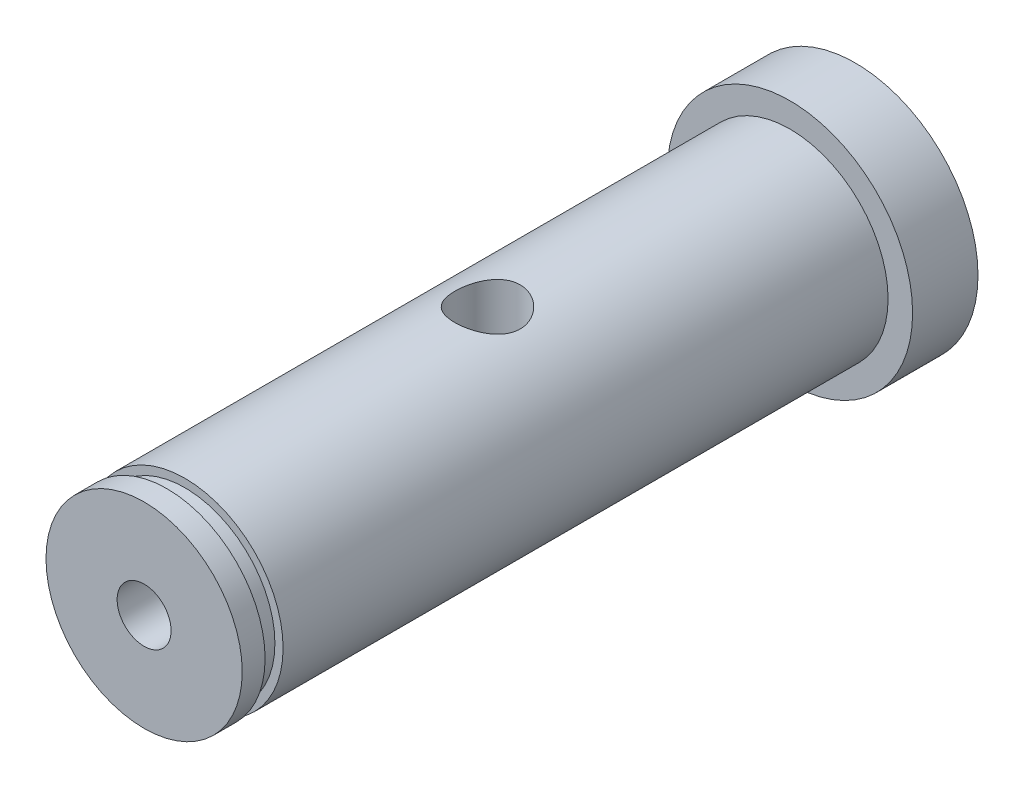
from build123d import *

# Parameters (mm, degrees)
SKETCH_1_R             = 6
EXTRUDE_1_DEPTH        = 21
SKETCH_2_R             = 7.249870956
SKETCH_2_R_2           = 5.5
CUT_EXTRUDE_1_DEPTH    = 1.1
HOLE_WIZARD_M4_1_D     = 3.3
HOLE_WIZARD_M4_1_DEPTH = 9.1
HOLE_WIZARD_M4_1_TIP   = 0.991420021
SKETCH_5_R             = 7.5
EXTRUDE_2_DEPTH        = 4
SKETCH_6_R             = 2
CUT_EXTRUDE_2_DEPTH    = 11.5


with BuildPart() as part:
    # Sketch 1 → Extrude 1 (new, symmetric)
    with BuildSketch(Plane.XY):
        with Locations(Location((0, 0, 0), (0, 0, 180))):
            Circle(SKETCH_1_R)
    extrude(amount=EXTRUDE_1_DEPTH, both=True)

    # Sketch 2 → Cut-Extrude 1 (cut)
    with BuildSketch(Plane.XY.offset(18.5)):
        Circle(SKETCH_2_R)
        Circle(SKETCH_2_R_2, mode=Mode.SUBTRACT)
    extrude(amount=CUT_EXTRUDE_1_DEPTH, mode=Mode.SUBTRACT)

    # Hole Wizard M4 _1
    with Locations(Plane.XY.offset(21)):
        with Locations((0, 0)):
            Hole(HOLE_WIZARD_M4_1_D / 2, depth=HOLE_WIZARD_M4_1_DEPTH)
            with Locations((0, 0, -(HOLE_WIZARD_M4_1_DEPTH + HOLE_WIZARD_M4_1_TIP / 2))):  # 118° drill point
                Cone(0, HOLE_WIZARD_M4_1_D / 2, HOLE_WIZARD_M4_1_TIP, mode=Mode.SUBTRACT)

    # Sketch 5 → Extrude 2 (add)
    with BuildSketch(Plane.XY.offset(-18.5)):
        Circle(SKETCH_5_R)
    extrude(amount=-EXTRUDE_2_DEPTH)

    # Sketch 6 → Cut-Extrude 2 (cut, symmetric)
    with BuildSketch(Plane(origin=(0, 0, 0), x_dir=(1, 0, 0), z_dir=(0, 1, 0))):
        with Locations(Location((0, 0, 0), (0, 0, 270))):
            Circle(SKETCH_6_R)
    extrude(amount=CUT_EXTRUDE_2_DEPTH, both=True, mode=Mode.SUBTRACT)


solid = part.part
